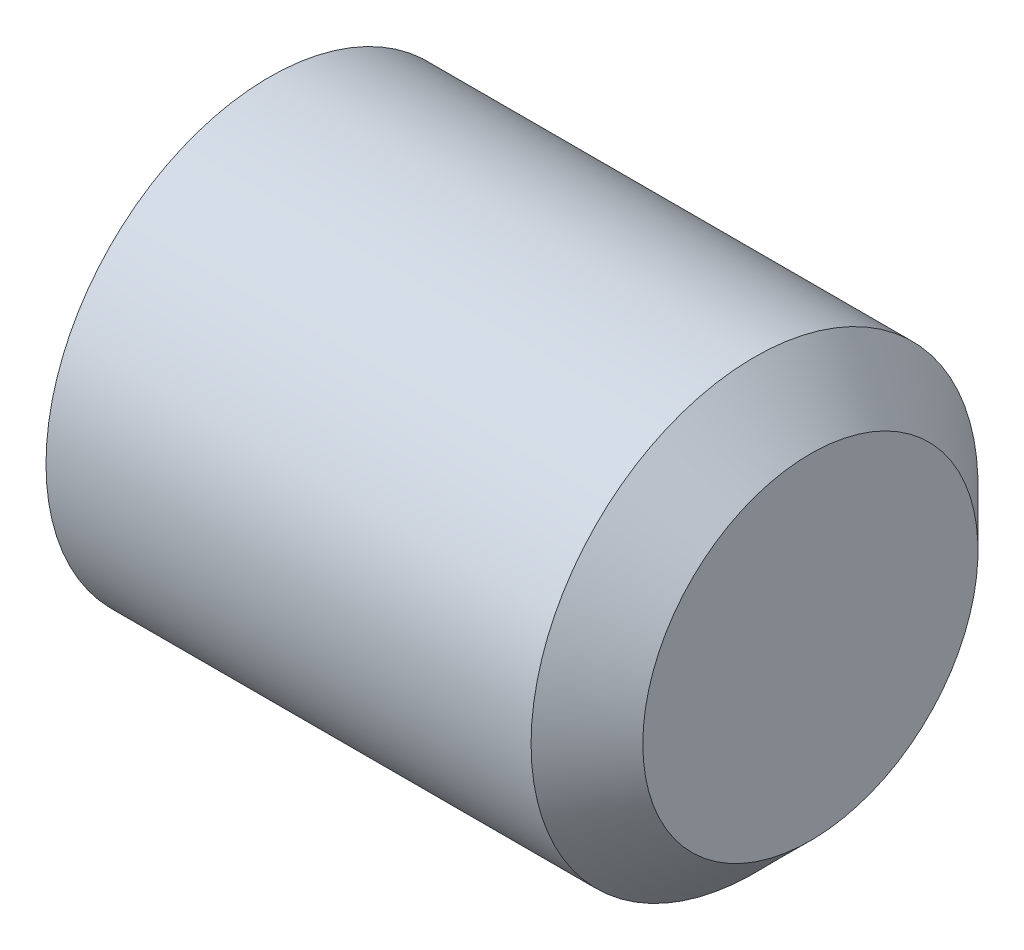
from build123d import *


with BuildPart() as part:
    # BodySke → BaseBody (revolve)
    with BuildSketch(Plane.XY, mode=Mode.PRIVATE) as basebody_sk:
        Polygon((0, 0), (0, 10.352), (0.951473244, 12), (27, 12), (30, 9), (30, 0), align=None)
    revolve(basebody_sk.sketch.rotate(Axis((-12.7, 0, 0), (1, 0, 0)), 90), axis=Axis((-12.7, 0, 0), (1, 0, 0)))


solid = part.part
